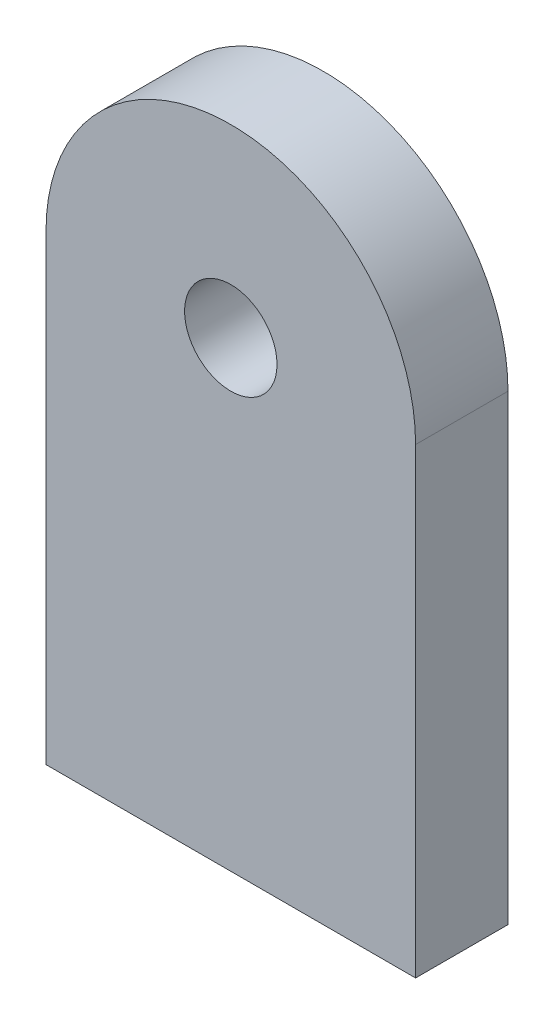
from build123d import *

# Parameters (mm, degrees)
BOSS_EXTRUDE1_DEPTH = 10
SKETCH2_R           = 5
CUT_EXTRUDE1_DEPTH  = 82.240384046


with BuildPart() as part:
    # Sketch1 → Boss-Extrude1 (new body)
    with BuildSketch(Plane.XY):
        with BuildLine():
            Line((0, 0), (0, 50))
            ThreePointArc((0, 50), (20, 70), (40, 50))
            Line((40, 50), (40, 0))
            Line((40, 0), (0, 0))
        make_face()
    extrude(amount=BOSS_EXTRUDE1_DEPTH)

    # Sketch2 → Cut-Extrude1 (cut, through all)
    with BuildSketch(Plane.XY.offset(10)):
        with Locations((20, 50)):
            Circle(SKETCH2_R)
    extrude(amount=-CUT_EXTRUDE1_DEPTH, mode=Mode.SUBTRACT)


solid = part.part
